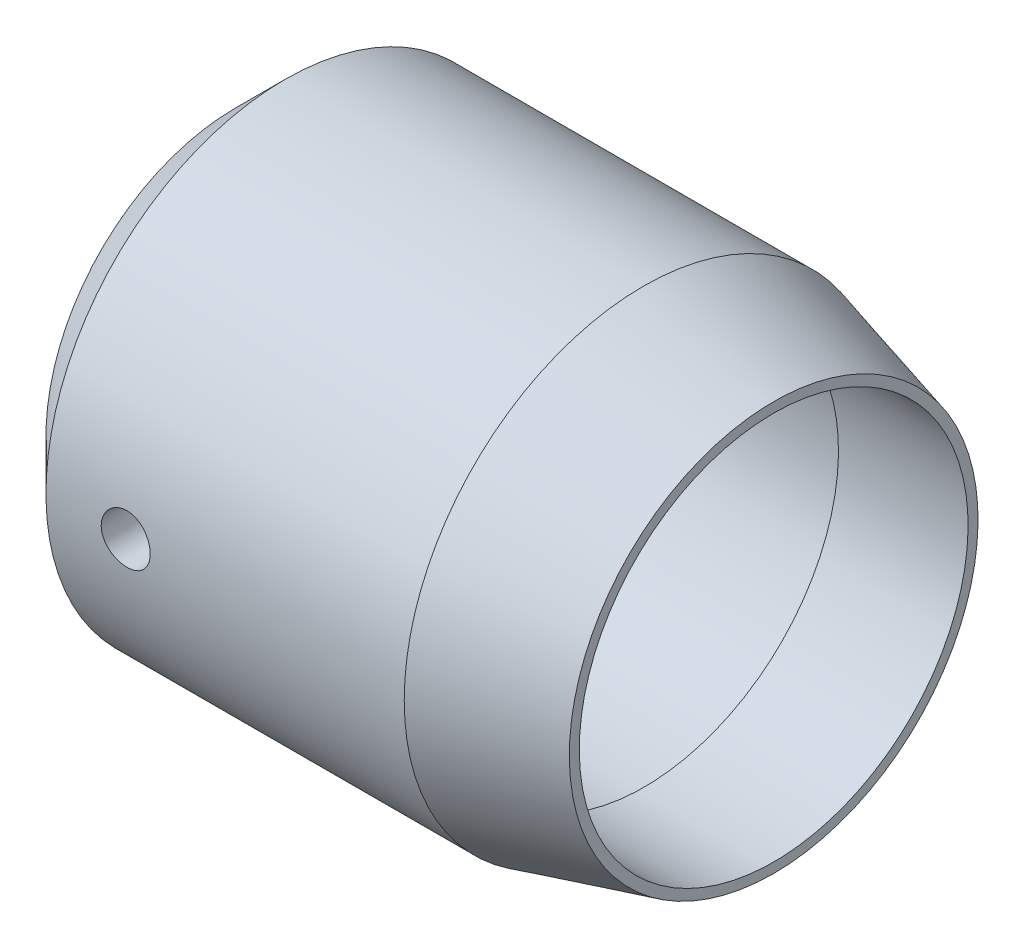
ISO-10303-21;
HEADER;
FILE_DESCRIPTION(('STEP AP214'),'2;1');
FILE_NAME('part.step','',(''),(''),'','','');
FILE_SCHEMA(('AUTOMOTIVE_DESIGN { 1 0 10303 214 1 1 1 1 }'));
ENDSEC;
DATA;
#1=APPLICATION_CONTEXT('core data for automotive mechanical design processes');
#2=APPLICATION_PROTOCOL_DEFINITION('international standard','automotive_design',2000,#1);
#3=PRODUCT_CONTEXT('',#1,'mechanical');
#4=PRODUCT('Part','Part','',(#3));
#5=PRODUCT_RELATED_PRODUCT_CATEGORY('part','',(#4));
#6=PRODUCT_DEFINITION_FORMATION('','',#4);
#7=PRODUCT_DEFINITION_CONTEXT('part definition',#1,'design');
#8=PRODUCT_DEFINITION('design','',#6,#7);
#9=PRODUCT_DEFINITION_SHAPE('','',#8);
#10=(LENGTH_UNIT() NAMED_UNIT(*) SI_UNIT(.MILLI.,.METRE.));
#11=(NAMED_UNIT(*) PLANE_ANGLE_UNIT() SI_UNIT($,.RADIAN.));
#12=(NAMED_UNIT(*) SI_UNIT($,.STERADIAN.) SOLID_ANGLE_UNIT());
#13=UNCERTAINTY_MEASURE_WITH_UNIT(LENGTH_MEASURE(1.E-05),#10,'distance_accuracy_value','');
#14=(GEOMETRIC_REPRESENTATION_CONTEXT(3) GLOBAL_UNCERTAINTY_ASSIGNED_CONTEXT((#13)) GLOBAL_UNIT_ASSIGNED_CONTEXT((#10,
#11,#12)) REPRESENTATION_CONTEXT('',''));
#15=CARTESIAN_POINT('',(0.,0.,0.));
#16=DIRECTION('',(0.,0.,1.));
#17=DIRECTION('',(1.,0.,0.));
#18=AXIS2_PLACEMENT_3D('',#15,#16,#17);
#19=CARTESIAN_POINT('',(-14.737312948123,-5.3147630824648,0.));
#20=DIRECTION('',(1.,0.,0.));
#21=DIRECTION('',(0.,1.,0.));
#22=AXIS2_PLACEMENT_3D('',#19,#20,#21);
#23=CYLINDRICAL_SURFACE('',#22,20.);
#24=CARTESIAN_POINT('',(-27.237312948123,-5.31476308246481,0.));
#25=DIRECTION('',(1.,0.,0.));
#26=DIRECTION('',(0.,1.,0.));
#27=AXIS2_PLACEMENT_3D('',#24,#25,#26);
#28=CIRCLE('',#27,20.);
#29=CARTESIAN_POINT('',(-27.237312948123,14.6852369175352,0.));
#30=VERTEX_POINT('',#29);
#31=EDGE_CURVE('E83',#30,#30,#28,.T.);
#32=ORIENTED_EDGE('',*,*,#31,.F.);
#33=EDGE_LOOP('',(#32));
#34=FACE_BOUND('',#33,.T.);
#35=CARTESIAN_POINT('',(-2.23731294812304,-5.3147630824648,0.));
#36=DIRECTION('',(1.,0.,0.));
#37=DIRECTION('',(0.,1.,0.));
#38=AXIS2_PLACEMENT_3D('',#35,#36,#37);
#39=CIRCLE('',#38,20.);
#40=CARTESIAN_POINT('',(-2.23731294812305,14.6852369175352,0.));
#41=VERTEX_POINT('',#40);
#42=EDGE_CURVE('E19',#41,#41,#39,.F.);
#43=ORIENTED_EDGE('',*,*,#42,.F.);
#44=EDGE_LOOP('',(#43));
#45=FACE_BOUND('',#44,.T.);
#46=ADVANCED_FACE('F14',(#34,#45),#23,.F.);
#47=CARTESIAN_POINT('',(-2.23731294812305,14.4352369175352,0.));
#48=DIRECTION('',(-1.,0.,0.));
#49=DIRECTION('',(0.,0.,1.));
#50=AXIS2_PLACEMENT_3D('',#47,#48,#49);
#51=PLANE('',#50);
#52=CARTESIAN_POINT('',(-2.23731294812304,-5.31476308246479,0.));
#53=DIRECTION('',(1.,0.,0.));
#54=DIRECTION('',(0.,1.,0.));
#55=AXIS2_PLACEMENT_3D('',#52,#53,#54);
#56=CIRCLE('',#55,19.5);
#57=CARTESIAN_POINT('',(-2.23731294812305,14.1852369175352,0.));
#58=VERTEX_POINT('',#57);
#59=EDGE_CURVE('E81',#58,#58,#56,.T.);
#60=ORIENTED_EDGE('',*,*,#59,.T.);
#61=EDGE_LOOP('',(#60));
#62=FACE_BOUND('',#61,.T.);
#63=ORIENTED_EDGE('',*,*,#42,.T.);
#64=EDGE_LOOP('',(#63));
#65=FACE_BOUND('',#64,.T.);
#66=ADVANCED_FACE('F90',(#62,#65),#51,.T.);
#67=CARTESIAN_POINT('',(-27.237312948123,10.6852369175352,0.));
#68=DIRECTION('',(1.,0.,0.));
#69=DIRECTION('',(0.,0.,-1.));
#70=AXIS2_PLACEMENT_3D('',#67,#68,#69);
#71=PLANE('',#70);
#72=CARTESIAN_POINT('',(-27.237312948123,-5.31476308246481,0.));
#73=DIRECTION('',(1.,0.,0.));
#74=DIRECTION('',(0.,1.,0.));
#75=AXIS2_PLACEMENT_3D('',#72,#73,#74);
#76=CIRCLE('',#75,12.);
#77=CARTESIAN_POINT('',(-27.237312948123,6.6852369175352,0.));
#78=VERTEX_POINT('',#77);
#79=EDGE_CURVE('E78',#78,#78,#76,.F.);
#80=ORIENTED_EDGE('',*,*,#79,.T.);
#81=EDGE_LOOP('',(#80));
#82=FACE_BOUND('',#81,.T.);
#83=ORIENTED_EDGE('',*,*,#31,.T.);
#84=EDGE_LOOP('',(#83));
#85=FACE_BOUND('',#84,.T.);
#86=ADVANCED_FACE('F98',(#82,#85),#71,.T.);
#87=CARTESIAN_POINT('',(4.26268705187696,-5.31476308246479,0.));
#88=DIRECTION('',(1.,0.,0.));
#89=DIRECTION('',(0.,1.,0.));
#90=AXIS2_PLACEMENT_3D('',#87,#88,#89);
#91=CYLINDRICAL_SURFACE('',#90,19.5);
#92=ORIENTED_EDGE('',*,*,#59,.F.);
#93=EDGE_LOOP('',(#92));
#94=FACE_BOUND('',#93,.T.);
#95=CARTESIAN_POINT('',(10.762687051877,-5.31476308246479,0.));
#96=DIRECTION('',(1.,0.,0.));
#97=DIRECTION('',(0.,1.,0.));
#98=AXIS2_PLACEMENT_3D('',#95,#96,#97);
#99=CIRCLE('',#98,19.5);
#100=CARTESIAN_POINT('',(10.762687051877,14.1852369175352,0.));
#101=VERTEX_POINT('',#100);
#102=EDGE_CURVE('E75',#101,#101,#99,.F.);
#103=ORIENTED_EDGE('',*,*,#102,.F.);
#104=EDGE_LOOP('',(#103));
#105=FACE_BOUND('',#104,.T.);
#106=ADVANCED_FACE('F65',(#94,#105),#91,.F.);
#107=CARTESIAN_POINT('',(-35.237312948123,-5.31476308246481,0.));
#108=DIRECTION('',(1.,0.,0.));
#109=DIRECTION('',(0.,1.,0.));
#110=AXIS2_PLACEMENT_3D('',#107,#108,#109);
#111=CYLINDRICAL_SURFACE('',#110,12.);
#112=CARTESIAN_POINT('',(-43.237312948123,-5.31476308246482,0.));
#113=DIRECTION('',(1.,0.,0.));
#114=DIRECTION('',(0.,1.,0.));
#115=AXIS2_PLACEMENT_3D('',#112,#113,#114);
#116=CIRCLE('',#115,12.);
#117=CARTESIAN_POINT('',(-43.237312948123,6.68523691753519,0.));
#118=VERTEX_POINT('',#117);
#119=EDGE_CURVE('E74',#118,#118,#116,.T.);
#120=ORIENTED_EDGE('',*,*,#119,.F.);
#121=EDGE_LOOP('',(#120));
#122=FACE_BOUND('',#121,.T.);
#123=ORIENTED_EDGE('',*,*,#79,.F.);
#124=EDGE_LOOP('',(#123));
#125=FACE_BOUND('',#124,.T.);
#126=CARTESIAN_POINT('',(-30.237312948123,-7.77326308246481,11.7454577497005));
#127=CARTESIAN_POINT('',(-30.1008103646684,-7.77325712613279,11.7454610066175));
#128=CARTESIAN_POINT('',(-29.9642253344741,-7.7618537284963,11.7478637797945));
#129=CARTESIAN_POINT('',(-29.6949015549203,-7.71657441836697,11.7572026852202));
#130=CARTESIAN_POINT('',(-29.5621668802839,-7.68267554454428,11.7641434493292));
#131=CARTESIAN_POINT('',(-29.3045111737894,-7.59350455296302,11.7817395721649));
#132=CARTESIAN_POINT('',(-29.1795817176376,-7.53825595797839,11.7923908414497));
#133=CARTESIAN_POINT('',(-28.9407779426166,-7.40801892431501,11.8162025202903));
#134=CARTESIAN_POINT('',(-28.8269022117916,-7.33303301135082,11.8293626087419));
#135=CARTESIAN_POINT('',(-28.6117389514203,-7.16426886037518,11.8569269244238));
#136=CARTESIAN_POINT('',(-28.5106381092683,-7.0702548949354,11.871345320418));
#137=CARTESIAN_POINT('',(-28.3255043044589,-6.8665854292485,11.8996805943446));
#138=CARTESIAN_POINT('',(-28.2414762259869,-6.75692546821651,11.9135973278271));
#139=CARTESIAN_POINT('',(-28.0921395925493,-6.52381293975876,11.9395172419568));
#140=CARTESIAN_POINT('',(-28.0270181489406,-6.40023826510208,11.9515008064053));
#141=CARTESIAN_POINT('',(-27.9185981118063,-6.1436966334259,11.9720240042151));
#142=CARTESIAN_POINT('',(-27.8752747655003,-6.01074052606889,11.9805675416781));
#143=CARTESIAN_POINT('',(-27.8220449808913,-5.78336958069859,11.9912000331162));
#144=CARTESIAN_POINT('',(-27.8058585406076,-5.69043202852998,11.9944835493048));
#145=CARTESIAN_POINT('',(-27.7842405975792,-5.50326374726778,11.9988845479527));
#146=CARTESIAN_POINT('',(-27.7788088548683,-5.40903304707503,12.0000020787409));
#147=CARTESIAN_POINT('',(-27.7788188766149,-5.17822657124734,11.9999969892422));
#148=CARTESIAN_POINT('',(-27.7902277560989,-5.04160769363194,11.9976453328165));
#149=CARTESIAN_POINT('',(-27.835530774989,-4.77221366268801,11.9884886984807));
#150=CARTESIAN_POINT('',(-27.8694477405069,-4.63944255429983,11.9816791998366));
#151=CARTESIAN_POINT('',(-27.9586710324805,-4.38171158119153,11.9643672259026));
#152=CARTESIAN_POINT('',(-28.0139543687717,-4.25674348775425,11.9538687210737));
#153=CARTESIAN_POINT('',(-28.1442747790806,-4.01787119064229,11.93031834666));
#154=CARTESIAN_POINT('',(-28.2193098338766,-3.90396585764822,11.9172667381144));
#155=CARTESIAN_POINT('',(-28.388134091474,-3.68881936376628,11.8898373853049));
#156=CARTESIAN_POINT('',(-28.4821497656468,-3.5877577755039,11.8754448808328));
#157=CARTESIAN_POINT('',(-28.6857805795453,-3.40272269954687,11.8470622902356));
#158=CARTESIAN_POINT('',(-28.7953971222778,-3.31875075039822,11.8330722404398));
#159=CARTESIAN_POINT('',(-29.0284156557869,-3.1695098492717,11.8069345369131));
#160=CARTESIAN_POINT('',(-29.1519396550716,-3.10442778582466,11.7948058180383));
#161=CARTESIAN_POINT('',(-29.4084592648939,-2.99601192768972,11.773973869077));
#162=CARTESIAN_POINT('',(-29.5414538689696,-2.95267582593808,11.7652702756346));
#163=CARTESIAN_POINT('',(-29.8112067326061,-2.88956650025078,11.7524233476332));
#164=CARTESIAN_POINT('',(-29.9478882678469,-2.86947799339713,11.7482190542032));
#165=CARTESIAN_POINT('',(-30.2227415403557,-2.85245452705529,11.7446633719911));
#166=CARTESIAN_POINT('',(-30.3609131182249,-2.8555171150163,11.7453114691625));
#167=CARTESIAN_POINT('',(-30.6325074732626,-2.88445429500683,11.7513320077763));
#168=CARTESIAN_POINT('',(-30.765970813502,-2.90996614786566,11.7566293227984));
#169=CARTESIAN_POINT('',(-31.0266830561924,-2.98250489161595,11.7712330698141));
#170=CARTESIAN_POINT('',(-31.1539316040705,-3.0295330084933,11.7805397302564));
#171=CARTESIAN_POINT('',(-31.399643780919,-3.14411400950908,11.8021899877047));
#172=CARTESIAN_POINT('',(-31.5180386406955,-3.21181021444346,11.8145546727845));
#173=CARTESIAN_POINT('',(-31.7419151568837,-3.36569947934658,11.8409132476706));
#174=CARTESIAN_POINT('',(-31.8473961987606,-3.45189341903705,11.8549072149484));
#175=CARTESIAN_POINT('',(-32.0445347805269,-3.64225138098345,11.8832704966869));
#176=CARTESIAN_POINT('',(-32.1358965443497,-3.74672162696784,11.8976419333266));
#177=CARTESIAN_POINT('',(-32.2998867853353,-3.96970982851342,11.9249078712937));
#178=CARTESIAN_POINT('',(-32.3725070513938,-4.08823390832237,11.9378017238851));
#179=CARTESIAN_POINT('',(-32.4970078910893,-4.33633433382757,11.9606953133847));
#180=CARTESIAN_POINT('',(-32.5488366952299,-4.46593730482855,11.970687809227));
#181=CARTESIAN_POINT('',(-32.6298000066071,-4.7320960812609,11.9865830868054));
#182=CARTESIAN_POINT('',(-32.6589821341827,-4.86863665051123,11.9924944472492));
#183=CARTESIAN_POINT('',(-32.6828762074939,-5.0576472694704,11.9973552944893));
#184=CARTESIAN_POINT('',(-32.6877232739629,-5.10893856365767,11.9983448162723));
#185=CARTESIAN_POINT('',(-32.6941928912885,-5.21173291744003,11.999667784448));
#186=CARTESIAN_POINT('',(-32.6958154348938,-5.26323597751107,12.0000012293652));
#187=CARTESIAN_POINT('',(-32.6958063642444,-5.45118426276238,11.9999967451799));
#188=CARTESIAN_POINT('',(-32.6844089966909,-5.58777398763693,11.9976475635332));
#189=CARTESIAN_POINT('',(-32.6391277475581,-5.85719854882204,11.9884952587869));
#190=CARTESIAN_POINT('',(-32.605199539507,-5.99002544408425,11.981683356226));
#191=CARTESIAN_POINT('',(-32.5159492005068,-6.24782734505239,11.9643661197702));
#192=CARTESIAN_POINT('',(-32.4606576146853,-6.37281326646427,11.9538660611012));
#193=CARTESIAN_POINT('',(-32.3303321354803,-6.61168467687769,11.9303150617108));
#194=CARTESIAN_POINT('',(-32.2553052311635,-6.72557407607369,11.9172650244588));
#195=CARTESIAN_POINT('',(-32.0865026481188,-6.94069301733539,11.8898391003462));
#196=CARTESIAN_POINT('',(-31.9925005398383,-7.04174302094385,11.8754484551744));
#197=CARTESIAN_POINT('',(-31.7888717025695,-7.22678267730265,11.8470657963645));
#198=CARTESIAN_POINT('',(-31.6792396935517,-7.31076654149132,11.833073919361));
#199=CARTESIAN_POINT('',(-31.4461524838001,-7.46005520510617,11.8069275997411));
#200=CARTESIAN_POINT('',(-31.3225702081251,-7.52516515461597,11.79479289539));
#201=CARTESIAN_POINT('',(-31.0660131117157,-7.63356138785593,11.7739648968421));
#202=CARTESIAN_POINT('',(-30.9330492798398,-7.6768727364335,11.765267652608));
#203=CARTESIAN_POINT('',(-30.7057100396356,-7.73006988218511,11.7544352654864));
#204=CARTESIAN_POINT('',(-30.6128146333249,-7.74624166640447,11.7510865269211));
#205=CARTESIAN_POINT('',(-30.4257302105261,-7.76784020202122,11.7465966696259));
#206=CARTESIAN_POINT('',(-30.3315412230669,-7.77326719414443,11.7454555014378));
#207=CARTESIAN_POINT('',(-30.237312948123,-7.77326308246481,11.7454577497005));
#208=B_SPLINE_CURVE_WITH_KNOTS('',3,(#126,#127,#128,#129,#130,#131,#132,#133,#134,#135,#136,
#137,#138,#139,#140,#141,#142,#143,#144,#145,#146,#147,#148,#149,#150,#151,#152,#153,#154,#155,
#156,#157,#158,#159,#160,#161,#162,#163,#164,#165,#166,#167,#168,#169,#170,#171,#172,#173,#174,
#175,#176,#177,#178,#179,#180,#181,#182,#183,#184,#185,#186,#187,#188,#189,#190,#191,#192,#193,
#194,#195,#196,#197,#198,#199,#200,#201,#202,#203,#204,#205,#206,#207),.UNSPECIFIED.,.T.,.F.,(4,
2,2,2,2,2,2,2,2,2,2,2,2,2,2,2,2,2,2,2,2,2,2,2,2,2,2,2,2,2,2,2,2,2,2,2,2,2,2,2,4),(0.,
0.409160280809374,0.818738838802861,1.2278674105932,1.63694365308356,2.051437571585,
2.4660499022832,2.88463557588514,3.30274484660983,3.58532126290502,3.86789137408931,
4.27715361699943,4.68683154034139,5.09606987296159,5.50526638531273,5.91966931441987,
6.33410953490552,6.75252023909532,7.17088654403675,7.58350991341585,7.99608957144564,
8.4021226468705,8.80817886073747,9.21711737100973,9.62607533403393,10.0426898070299,
10.4594865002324,10.8773146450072,11.2942618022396,11.4487683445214,11.6032752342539,
12.0123417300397,12.4222154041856,12.8315052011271,13.240650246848,13.6550016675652,
14.0694933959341,14.4881231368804,14.9062704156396,15.1887217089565,15.4711666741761),.UNSPECIFIED.);
#209=CARTESIAN_POINT('',(-30.237312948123,-7.77326308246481,11.7454577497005));
#210=VERTEX_POINT('',#209);
#211=EDGE_CURVE('E69',#210,#210,#208,.T.);
#212=ORIENTED_EDGE('',*,*,#211,.T.);
#213=EDGE_LOOP('',(#212));
#214=FACE_BOUND('',#213,.T.);
#215=ADVANCED_FACE('F60',(#122,#125,#214),#111,.F.);
#216=CARTESIAN_POINT('',(10.762687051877,14.6852369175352,0.));
#217=DIRECTION('',(1.,0.,0.));
#218=DIRECTION('',(0.,0.,-1.));
#219=AXIS2_PLACEMENT_3D('',#216,#217,#218);
#220=PLANE('',#219);
#221=ORIENTED_EDGE('',*,*,#102,.T.);
#222=EDGE_LOOP('',(#221));
#223=FACE_BOUND('',#222,.T.);
#224=CARTESIAN_POINT('',(10.7626870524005,-5.31476308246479,0.));
#225=DIRECTION('',(-1.,0.,0.));
#226=DIRECTION('',(0.,-1.,0.));
#227=AXIS2_PLACEMENT_3D('',#224,#225,#226);
#228=CIRCLE('',#227,20.5000000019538);
#229=CARTESIAN_POINT('',(10.7626870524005,-25.8147630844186,0.));
#230=VERTEX_POINT('',#229);
#231=EDGE_CURVE('E38',#230,#230,#228,.T.);
#232=ORIENTED_EDGE('',*,*,#231,.F.);
#233=EDGE_LOOP('',(#232));
#234=FACE_BOUND('',#233,.T.);
#235=ADVANCED_FACE('F57',(#223,#234),#220,.T.);
#236=CARTESIAN_POINT('',(-30.237312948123,-5.31476308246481,24.0016593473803));
#237=DIRECTION('',(0.,0.,-1.));
#238=DIRECTION('',(-1.,0.,0.));
#239=AXIS2_PLACEMENT_3D('',#236,#237,#238);
#240=CYLINDRICAL_SURFACE('',#239,2.4585);
#241=ORIENTED_EDGE('',*,*,#211,.F.);
#242=EDGE_LOOP('',(#241));
#243=FACE_BOUND('',#242,.T.);
#244=CARTESIAN_POINT('',(-27.778812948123,-5.31476308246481,24.));
#245=CARTESIAN_POINT('',(-27.7788188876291,-5.4523487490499,23.9999984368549));
#246=CARTESIAN_POINT('',(-27.7904102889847,-5.59011659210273,23.9988034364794));
#247=CARTESIAN_POINT('',(-27.8364987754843,-5.86192445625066,23.9941488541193));
#248=CARTESIAN_POINT('',(-27.8710439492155,-5.99595603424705,23.9906845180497));
#249=CARTESIAN_POINT('',(-27.9620270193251,-6.25617818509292,23.9818820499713));
#250=CARTESIAN_POINT('',(-28.0184431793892,-6.38237639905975,23.9765457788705));
#251=CARTESIAN_POINT('',(-28.1515248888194,-6.6234515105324,23.9645971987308));
#252=CARTESIAN_POINT('',(-28.2281816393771,-6.73833329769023,23.9579854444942));
#253=CARTESIAN_POINT('',(-28.3998931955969,-6.95402393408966,23.9441968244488));
#254=CARTESIAN_POINT('',(-28.4950104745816,-7.05478293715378,23.9370180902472));
#255=CARTESIAN_POINT('',(-28.7008138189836,-7.23894150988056,23.9229197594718));
#256=CARTESIAN_POINT('',(-28.8115013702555,-7.32233942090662,23.9160001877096));
#257=CARTESIAN_POINT('',(-29.0456018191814,-7.46957355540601,23.9031856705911));
#258=CARTESIAN_POINT('',(-29.1690422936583,-7.53336614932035,23.8972930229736));
#259=CARTESIAN_POINT('',(-29.4249524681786,-7.63929940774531,23.8872220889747));
#260=CARTESIAN_POINT('',(-29.5574218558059,-7.68144082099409,23.8830437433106));
#261=CARTESIAN_POINT('',(-29.8271356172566,-7.74273236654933,23.8768909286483));
#262=CARTESIAN_POINT('',(-29.9643615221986,-7.76196298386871,23.8749087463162));
#263=CARTESIAN_POINT('',(-30.2401066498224,-7.77713585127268,23.8733487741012));
#264=CARTESIAN_POINT('',(-30.3786258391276,-7.77307870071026,23.8737709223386));
#265=CARTESIAN_POINT('',(-30.6524685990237,-7.7418575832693,23.8769648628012));
#266=CARTESIAN_POINT('',(-30.7878023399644,-7.71478177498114,23.8797276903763));
#267=CARTESIAN_POINT('',(-31.0519958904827,-7.63842870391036,23.8872777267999));
#268=CARTESIAN_POINT('',(-31.1808555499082,-7.58915092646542,23.8920649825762));
#269=CARTESIAN_POINT('',(-31.4287239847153,-7.46969369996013,23.9031349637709));
#270=CARTESIAN_POINT('',(-31.5477134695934,-7.39947449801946,23.9094205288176));
#271=CARTESIAN_POINT('',(-31.7722420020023,-7.2401624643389,23.9227758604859));
#272=CARTESIAN_POINT('',(-31.8777817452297,-7.15107060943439,23.9298455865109));
#273=CARTESIAN_POINT('',(-32.0729194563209,-6.95606822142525,23.9440116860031));
#274=CARTESIAN_POINT('',(-32.1624446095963,-6.85008481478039,23.9511080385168));
#275=CARTESIAN_POINT('',(-32.3224864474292,-6.6244969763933,23.9645017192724));
#276=CARTESIAN_POINT('',(-32.3929943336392,-6.50488627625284,23.9707986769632));
#277=CARTESIAN_POINT('',(-32.5129893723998,-6.25535737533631,23.9818867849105));
#278=CARTESIAN_POINT('',(-32.5624552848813,-6.12542891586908,23.9866764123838));
#279=CARTESIAN_POINT('',(-32.6387454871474,-5.85922793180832,23.9941908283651));
#280=CARTESIAN_POINT('',(-32.665617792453,-5.72296951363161,23.996919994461));
#281=CARTESIAN_POINT('',(-32.6858357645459,-5.54062749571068,23.9989797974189));
#282=CARTESIAN_POINT('',(-32.6895744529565,-5.49554191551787,23.9993616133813));
#283=CARTESIAN_POINT('',(-32.6945640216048,-5.40523181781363,23.9998719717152));
#284=CARTESIAN_POINT('',(-32.6958149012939,-5.36000730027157,24.0000005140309));
#285=CARTESIAN_POINT('',(-32.6958070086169,-5.17717741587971,23.9999984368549));
#286=CARTESIAN_POINT('',(-32.6842156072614,-5.03940957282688,23.9988034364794));
#287=CARTESIAN_POINT('',(-32.6381271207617,-4.76760170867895,23.9941488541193));
#288=CARTESIAN_POINT('',(-32.6035819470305,-4.63357013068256,23.9906845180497));
#289=CARTESIAN_POINT('',(-32.5125988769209,-4.37334797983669,23.9818820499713));
#290=CARTESIAN_POINT('',(-32.4561827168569,-4.24714976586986,23.9765457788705));
#291=CARTESIAN_POINT('',(-32.3231010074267,-4.00607465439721,23.9645971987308));
#292=CARTESIAN_POINT('',(-32.246444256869,-3.89119286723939,23.9579854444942));
#293=CARTESIAN_POINT('',(-32.0747327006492,-3.67550223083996,23.9441968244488));
#294=CARTESIAN_POINT('',(-31.9796154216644,-3.57474322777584,23.9370180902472));
#295=CARTESIAN_POINT('',(-31.7738120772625,-3.39058465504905,23.9229197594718));
#296=CARTESIAN_POINT('',(-31.6631245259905,-3.30718674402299,23.9160001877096));
#297=CARTESIAN_POINT('',(-31.4290240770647,-3.15995260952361,23.9031856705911));
#298=CARTESIAN_POINT('',(-31.3055836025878,-3.09616001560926,23.8972930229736));
#299=CARTESIAN_POINT('',(-31.0496734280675,-2.99022675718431,23.8872220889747));
#300=CARTESIAN_POINT('',(-30.9172040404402,-2.94808534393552,23.8830437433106));
#301=CARTESIAN_POINT('',(-30.6474902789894,-2.88679379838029,23.8768909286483));
#302=CARTESIAN_POINT('',(-30.5102643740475,-2.8675631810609,23.8749087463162));
#303=CARTESIAN_POINT('',(-30.2345192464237,-2.85239031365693,23.8733487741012));
#304=CARTESIAN_POINT('',(-30.0960000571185,-2.85644746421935,23.8737709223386));
#305=CARTESIAN_POINT('',(-29.8221572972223,-2.88766858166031,23.8769648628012));
#306=CARTESIAN_POINT('',(-29.6868235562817,-2.91474438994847,23.8797276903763));
#307=CARTESIAN_POINT('',(-29.4226300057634,-2.99109746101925,23.8872777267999));
#308=CARTESIAN_POINT('',(-29.2937703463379,-3.04037523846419,23.8920649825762));
#309=CARTESIAN_POINT('',(-29.0459019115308,-3.15983246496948,23.9031349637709));
#310=CARTESIAN_POINT('',(-28.9269124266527,-3.23005166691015,23.9094205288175));
#311=CARTESIAN_POINT('',(-28.7023838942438,-3.38936370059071,23.9227758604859));
#312=CARTESIAN_POINT('',(-28.5968441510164,-3.47845555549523,23.9298455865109));
#313=CARTESIAN_POINT('',(-28.4017064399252,-3.67345794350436,23.9440116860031));
#314=CARTESIAN_POINT('',(-28.3121812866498,-3.77944135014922,23.9511080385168));
#315=CARTESIAN_POINT('',(-28.1521394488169,-4.00502918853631,23.9645017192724));
#316=CARTESIAN_POINT('',(-28.0816315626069,-4.12463988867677,23.9707986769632));
#317=CARTESIAN_POINT('',(-27.9616365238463,-4.3741687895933,23.9818867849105));
#318=CARTESIAN_POINT('',(-27.9121706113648,-4.50409724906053,23.9866764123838));
#319=CARTESIAN_POINT('',(-27.8358804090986,-4.77029823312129,23.9941908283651));
#320=CARTESIAN_POINT('',(-27.809008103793,-4.906556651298,23.996919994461));
#321=CARTESIAN_POINT('',(-27.7887901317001,-5.08889866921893,23.9989797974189));
#322=CARTESIAN_POINT('',(-27.7850514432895,-5.13398424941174,23.9993616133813));
#323=CARTESIAN_POINT('',(-27.7800618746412,-5.22429434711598,23.9998719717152));
#324=CARTESIAN_POINT('',(-27.7788109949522,-5.26951886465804,24.0000005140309));
#325=CARTESIAN_POINT('',(-27.778812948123,-5.31476308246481,24.));
#326=B_SPLINE_CURVE_WITH_KNOTS('',3,(#244,#245,#246,#247,#248,#249,#250,#251,#252,#253,#254,
#255,#256,#257,#258,#259,#260,#261,#262,#263,#264,#265,#266,#267,#268,#269,#270,#271,#272,#273,
#274,#275,#276,#277,#278,#279,#280,#281,#282,#283,#284,#285,#286,#287,#288,#289,#290,#291,#292,
#293,#294,#295,#296,#297,#298,#299,#300,#301,#302,#303,#304,#305,#306,#307,#308,#309,#310,#311,
#312,#313,#314,#315,#316,#317,#318,#319,#320,#321,#322,#323,#324,#325),.UNSPECIFIED.,.T.,.F.,(4,
2,2,2,2,2,2,2,2,2,2,2,2,2,2,2,2,2,2,2,2,2,2,2,2,2,2,2,2,2,2,2,2,2,2,2,2,2,2,2,4),(0.,
0.412584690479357,0.826036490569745,1.239078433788,1.65194111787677,2.0662261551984,
2.48055075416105,2.89579082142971,3.31101652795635,3.72477921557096,4.13853125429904,
4.55070577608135,4.96288985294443,5.37586140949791,5.78881159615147,6.2035941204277,
6.61856821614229,7.03396020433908,7.44846716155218,7.58414312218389,7.71981911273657,
8.13240380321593,8.54585560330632,8.95889754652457,9.37176023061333,9.78604526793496,
10.2003698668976,10.6156099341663,11.0308356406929,11.4445983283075,11.8583503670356,
12.2705248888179,12.682708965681,13.0956805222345,13.508630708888,13.9234132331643,
14.3383873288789,14.7537793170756,15.1682862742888,15.3039622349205,15.4396382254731),.UNSPECIFIED.);
#327=CARTESIAN_POINT('',(-27.778812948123,-5.31476308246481,24.));
#328=VERTEX_POINT('',#327);
#329=EDGE_CURVE('E33',#328,#328,#326,.T.);
#330=ORIENTED_EDGE('',*,*,#329,.F.);
#331=EDGE_LOOP('',(#330));
#332=FACE_BOUND('',#331,.T.);
#333=ADVANCED_FACE('F16',(#243,#332),#240,.F.);
#334=CARTESIAN_POINT('',(-43.237312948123,12.6852369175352,0.));
#335=DIRECTION('',(-1.,0.,0.));
#336=DIRECTION('',(0.,0.,1.));
#337=AXIS2_PLACEMENT_3D('',#334,#335,#336);
#338=PLANE('',#337);
#339=ORIENTED_EDGE('',*,*,#119,.T.);
#340=EDGE_LOOP('',(#339));
#341=FACE_BOUND('',#340,.T.);
#342=CARTESIAN_POINT('',(-43.2373129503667,-5.31476308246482,0.));
#343=DIRECTION('',(1.,0.,0.));
#344=DIRECTION('',(0.,1.,0.));
#345=AXIS2_PLACEMENT_3D('',#342,#343,#344);
#346=CIRCLE('',#345,19.0000000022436);
#347=CARTESIAN_POINT('',(-43.2373129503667,13.6852369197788,0.));
#348=VERTEX_POINT('',#347);
#349=EDGE_CURVE('E28',#348,#348,#346,.T.);
#350=ORIENTED_EDGE('',*,*,#349,.F.);
#351=EDGE_LOOP('',(#350));
#352=FACE_BOUND('',#351,.T.);
#353=ADVANCED_FACE('F52',(#341,#352),#338,.T.);
#354=CARTESIAN_POINT('',(-2.29949077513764,-5.3147630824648,0.));
#355=DIRECTION('',(-1.,0.,0.));
#356=DIRECTION('',(0.,-1.,0.));
#357=AXIS2_PLACEMENT_3D('',#354,#355,#356);
#358=CONICAL_SURFACE('',#357,23.9999999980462,0.2617993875);
#359=ORIENTED_EDGE('',*,*,#231,.T.);
#360=EDGE_LOOP('',(#359));
#361=FACE_BOUND('',#360,.T.);
#362=CARTESIAN_POINT('',(-2.29949077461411,-5.31476308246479,0.));
#363=DIRECTION('',(1.,0.,0.));
#364=DIRECTION('',(0.,1.,0.));
#365=AXIS2_PLACEMENT_3D('',#362,#363,#364);
#366=CIRCLE('',#365,24.);
#367=CARTESIAN_POINT('',(-2.29949077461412,18.6852369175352,0.));
#368=VERTEX_POINT('',#367);
#369=EDGE_CURVE('E23',#368,#368,#366,.F.);
#370=ORIENTED_EDGE('',*,*,#369,.F.);
#371=EDGE_LOOP('',(#370));
#372=FACE_BOUND('',#371,.T.);
#373=ADVANCED_FACE('F48',(#361,#372),#358,.T.);
#374=CARTESIAN_POINT('',(-38.2373129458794,-5.31476308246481,0.));
#375=DIRECTION('',(1.,0.,0.));
#376=DIRECTION('',(0.,1.,0.));
#377=AXIS2_PLACEMENT_3D('',#374,#375,#376);
#378=CONICAL_SURFACE('',#377,23.9999999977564,0.785398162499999);
#379=ORIENTED_EDGE('',*,*,#349,.T.);
#380=EDGE_LOOP('',(#379));
#381=FACE_BOUND('',#380,.T.);
#382=CARTESIAN_POINT('',(-38.237312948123,-5.31476308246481,0.));
#383=DIRECTION('',(1.,0.,0.));
#384=DIRECTION('',(0.,1.,0.));
#385=AXIS2_PLACEMENT_3D('',#382,#383,#384);
#386=CIRCLE('',#385,24.);
#387=CARTESIAN_POINT('',(-38.237312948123,18.6852369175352,0.));
#388=VERTEX_POINT('',#387);
#389=EDGE_CURVE('E9',#388,#388,#386,.T.);
#390=ORIENTED_EDGE('',*,*,#389,.F.);
#391=EDGE_LOOP('',(#390));
#392=FACE_BOUND('',#391,.T.);
#393=ADVANCED_FACE('F44',(#381,#392),#378,.T.);
#394=CARTESIAN_POINT('',(-22.7684018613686,-5.31476308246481,0.));
#395=DIRECTION('',(1.,0.,0.));
#396=DIRECTION('',(0.,1.,0.));
#397=AXIS2_PLACEMENT_3D('',#394,#395,#396);
#398=CYLINDRICAL_SURFACE('',#397,24.);
#399=ORIENTED_EDGE('',*,*,#369,.T.);
#400=EDGE_LOOP('',(#399));
#401=FACE_BOUND('',#400,.T.);
#402=ORIENTED_EDGE('',*,*,#389,.T.);
#403=EDGE_LOOP('',(#402));
#404=FACE_BOUND('',#403,.T.);
#405=ORIENTED_EDGE('',*,*,#329,.T.);
#406=EDGE_LOOP('',(#405));
#407=FACE_BOUND('',#406,.T.);
#408=ADVANCED_FACE('F40',(#401,#404,#407),#398,.T.);
#409=CLOSED_SHELL('',(#46,#66,#86,#106,#215,#235,#333,#353,#373,#393,#408));
#410=MANIFOLD_SOLID_BREP('B1',#409);
#411=ADVANCED_BREP_SHAPE_REPRESENTATION('',(#18,#410),#14);
#412=SHAPE_DEFINITION_REPRESENTATION(#9,#411);
ENDSEC;
END-ISO-10303-21;
